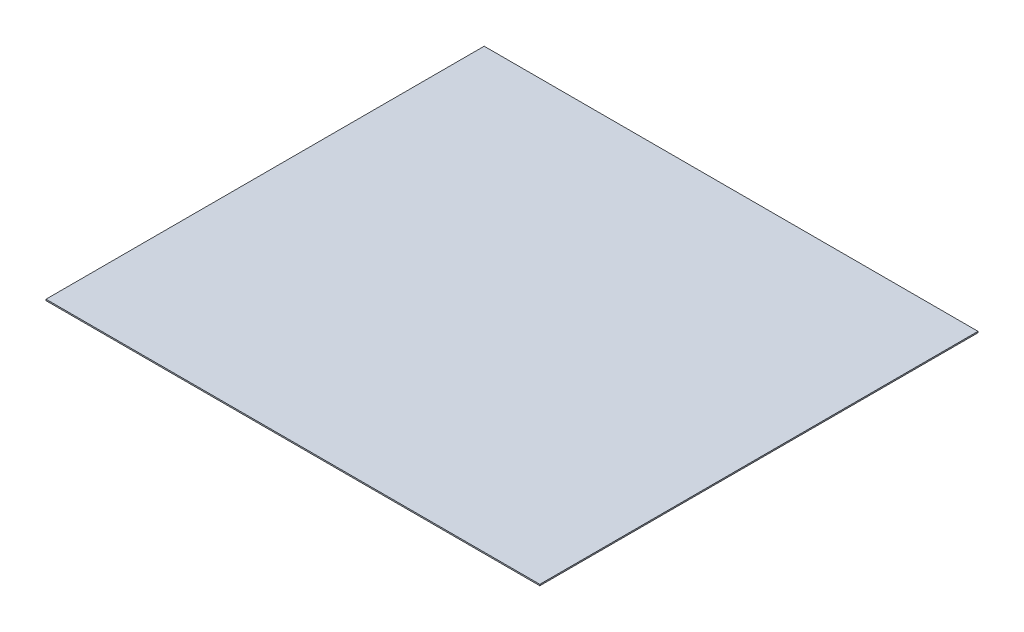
from build123d import *

# Parameters (mm, degrees)
SKETCH1_W           = 1803.4
SKETCH1_H           = 1600.2
BOSS_EXTRUDE1_DEPTH = 4.7625


with BuildPart() as part:
    # Sketch1 → Boss-Extrude1 (new body)
    with BuildSketch(Plane(origin=(0, 0, 0), x_dir=(1, 0, 0), z_dir=(0, 1, 0))):
        Rectangle(SKETCH1_W, SKETCH1_H)
    extrude(amount=BOSS_EXTRUDE1_DEPTH)


solid = part.part
